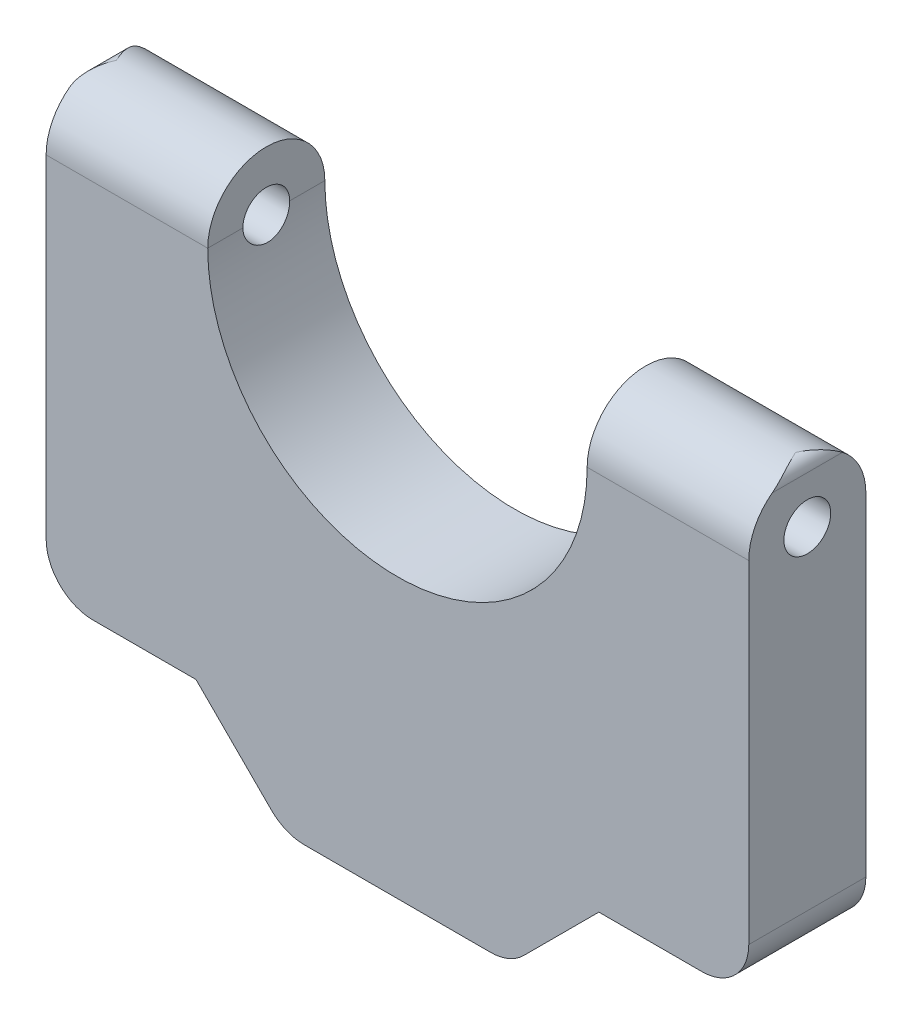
ISO-10303-21;
HEADER;
FILE_DESCRIPTION(('STEP AP214'),'2;1');
FILE_NAME('part.step','',(''),(''),'','','');
FILE_SCHEMA(('AUTOMOTIVE_DESIGN { 1 0 10303 214 1 1 1 1 }'));
ENDSEC;
DATA;
#1=APPLICATION_CONTEXT('core data for automotive mechanical design processes');
#2=APPLICATION_PROTOCOL_DEFINITION('international standard','automotive_design',2000,#1);
#3=PRODUCT_CONTEXT('',#1,'mechanical');
#4=PRODUCT('Part','Part','',(#3));
#5=PRODUCT_RELATED_PRODUCT_CATEGORY('part','',(#4));
#6=PRODUCT_DEFINITION_FORMATION('','',#4);
#7=PRODUCT_DEFINITION_CONTEXT('part definition',#1,'design');
#8=PRODUCT_DEFINITION('design','',#6,#7);
#9=PRODUCT_DEFINITION_SHAPE('','',#8);
#10=(LENGTH_UNIT() NAMED_UNIT(*) SI_UNIT(.MILLI.,.METRE.));
#11=(NAMED_UNIT(*) PLANE_ANGLE_UNIT() SI_UNIT($,.RADIAN.));
#12=(NAMED_UNIT(*) SI_UNIT($,.STERADIAN.) SOLID_ANGLE_UNIT());
#13=UNCERTAINTY_MEASURE_WITH_UNIT(LENGTH_MEASURE(1.E-05),#10,'distance_accuracy_value','');
#14=(GEOMETRIC_REPRESENTATION_CONTEXT(3) GLOBAL_UNCERTAINTY_ASSIGNED_CONTEXT((#13)) GLOBAL_UNIT_ASSIGNED_CONTEXT((#10,
#11,#12)) REPRESENTATION_CONTEXT('',''));
#15=CARTESIAN_POINT('',(0.,0.,0.));
#16=DIRECTION('',(0.,0.,1.));
#17=DIRECTION('',(1.,0.,0.));
#18=AXIS2_PLACEMENT_3D('',#15,#16,#17);
#19=CARTESIAN_POINT('',(-3.97157287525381,-18.,2.5));
#20=DIRECTION('',(0.,0.,1.));
#21=DIRECTION('',(1.,0.,0.));
#22=AXIS2_PLACEMENT_3D('',#19,#20,#21);
#23=CYLINDRICAL_SURFACE('',#22,2.);
#24=CARTESIAN_POINT('',(-3.97157287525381,-18.,2.5));
#25=DIRECTION('',(0.,0.,1.));
#26=DIRECTION('',(1.,0.,0.));
#27=AXIS2_PLACEMENT_3D('',#24,#25,#26);
#28=CIRCLE('',#27,2.);
#29=CARTESIAN_POINT('',(-5.38578643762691,-19.4142135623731,2.5));
#30=VERTEX_POINT('',#29);
#31=CARTESIAN_POINT('',(-3.97157287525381,-20.,2.5));
#32=VERTEX_POINT('',#31);
#33=EDGE_CURVE('E285',#30,#32,#28,.T.);
#34=ORIENTED_EDGE('',*,*,#33,.F.);
#35=DIRECTION('',(0.,0.,1.));
#36=VECTOR('',#35,1.);
#37=CARTESIAN_POINT('',(-5.38578643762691,-19.4142135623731,2.5));
#38=LINE('',#37,#36);
#39=CARTESIAN_POINT('',(-5.38578643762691,-19.4142135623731,-2.5));
#40=VERTEX_POINT('',#39);
#41=EDGE_CURVE('E304',#30,#40,#38,.F.);
#42=ORIENTED_EDGE('',*,*,#41,.T.);
#43=CARTESIAN_POINT('',(-3.97157287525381,-18.,-2.5));
#44=DIRECTION('',(0.,0.,1.));
#45=DIRECTION('',(1.,0.,0.));
#46=AXIS2_PLACEMENT_3D('',#43,#44,#45);
#47=CIRCLE('',#46,2.);
#48=CARTESIAN_POINT('',(-3.97157287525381,-20.,-2.5));
#49=VERTEX_POINT('',#48);
#50=EDGE_CURVE('E17',#40,#49,#47,.T.);
#51=ORIENTED_EDGE('',*,*,#50,.T.);
#52=DIRECTION('',(0.,0.,1.));
#53=VECTOR('',#52,1.);
#54=CARTESIAN_POINT('',(-3.97157287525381,-20.,2.5));
#55=LINE('',#54,#53);
#56=EDGE_CURVE('E302',#49,#32,#55,.T.);
#57=ORIENTED_EDGE('',*,*,#56,.T.);
#58=EDGE_LOOP('',(#34,#42,#51,#57));
#59=FACE_BOUND('',#58,.T.);
#60=ADVANCED_FACE('F14',(#59),#23,.T.);
#61=CARTESIAN_POINT('',(3.97157287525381,-18.,2.5));
#62=DIRECTION('',(0.,0.,1.));
#63=DIRECTION('',(1.,0.,0.));
#64=AXIS2_PLACEMENT_3D('',#61,#62,#63);
#65=CYLINDRICAL_SURFACE('',#64,2.);
#66=CARTESIAN_POINT('',(3.97157287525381,-18.,2.5));
#67=DIRECTION('',(0.,0.,1.));
#68=DIRECTION('',(1.,0.,0.));
#69=AXIS2_PLACEMENT_3D('',#66,#67,#68);
#70=CIRCLE('',#69,2.);
#71=CARTESIAN_POINT('',(3.97157287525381,-20.,2.5));
#72=VERTEX_POINT('',#71);
#73=CARTESIAN_POINT('',(5.38578643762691,-19.4142135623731,2.5));
#74=VERTEX_POINT('',#73);
#75=EDGE_CURVE('E283',#72,#74,#70,.T.);
#76=ORIENTED_EDGE('',*,*,#75,.F.);
#77=DIRECTION('',(0.,0.,1.));
#78=VECTOR('',#77,1.);
#79=CARTESIAN_POINT('',(3.97157287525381,-20.,2.5));
#80=LINE('',#79,#78);
#81=CARTESIAN_POINT('',(3.97157287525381,-20.,-2.5));
#82=VERTEX_POINT('',#81);
#83=EDGE_CURVE('E354',#72,#82,#80,.F.);
#84=ORIENTED_EDGE('',*,*,#83,.T.);
#85=CARTESIAN_POINT('',(3.97157287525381,-18.,-2.5));
#86=DIRECTION('',(0.,0.,1.));
#87=DIRECTION('',(1.,0.,0.));
#88=AXIS2_PLACEMENT_3D('',#85,#86,#87);
#89=CIRCLE('',#88,2.);
#90=CARTESIAN_POINT('',(5.38578643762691,-19.4142135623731,-2.5));
#91=VERTEX_POINT('',#90);
#92=EDGE_CURVE('E292',#82,#91,#89,.T.);
#93=ORIENTED_EDGE('',*,*,#92,.T.);
#94=DIRECTION('',(0.,0.,1.));
#95=VECTOR('',#94,1.);
#96=CARTESIAN_POINT('',(5.38578643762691,-19.4142135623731,2.5));
#97=LINE('',#96,#95);
#98=EDGE_CURVE('E353',#91,#74,#97,.T.);
#99=ORIENTED_EDGE('',*,*,#98,.T.);
#100=EDGE_LOOP('',(#76,#84,#93,#99));
#101=FACE_BOUND('',#100,.T.);
#102=ADVANCED_FACE('F429',(#101),#65,.T.);
#103=CARTESIAN_POINT('',(8.1,2.5,2.5));
#104=DIRECTION('',(1.,0.,0.));
#105=DIRECTION('',(0.,0.,-1.));
#106=AXIS2_PLACEMENT_3D('',#103,#104,#105);
#107=PLANE('',#106);
#108=CARTESIAN_POINT('',(8.1,0.,0.));
#109=DIRECTION('',(1.,0.,0.));
#110=DIRECTION('',(0.,0.,-1.));
#111=AXIS2_PLACEMENT_3D('',#108,#109,#110);
#112=CIRCLE('',#111,2.5);
#113=CARTESIAN_POINT('',(8.1,0.,-2.5));
#114=VERTEX_POINT('',#113);
#115=CARTESIAN_POINT('',(8.1,0.,2.5));
#116=VERTEX_POINT('',#115);
#117=EDGE_CURVE('E266',#114,#116,#112,.T.);
#118=ORIENTED_EDGE('',*,*,#117,.F.);
#119=DIRECTION('',(0.,0.,-1.));
#120=VECTOR('',#119,1.);
#121=CARTESIAN_POINT('',(8.1,0.,2.5));
#122=LINE('',#121,#120);
#123=CARTESIAN_POINT('',(8.1,0.,-1.));
#124=VERTEX_POINT('',#123);
#125=EDGE_CURVE('E293',#124,#114,#122,.T.);
#126=ORIENTED_EDGE('',*,*,#125,.F.);
#127=CARTESIAN_POINT('',(8.1,0.,0.));
#128=DIRECTION('',(1.,0.,0.));
#129=DIRECTION('',(0.,0.,-1.));
#130=AXIS2_PLACEMENT_3D('',#127,#128,#129);
#131=CIRCLE('',#130,1.);
#132=CARTESIAN_POINT('',(8.1,0.,1.));
#133=VERTEX_POINT('',#132);
#134=EDGE_CURVE('E289',#124,#133,#131,.T.);
#135=ORIENTED_EDGE('',*,*,#134,.T.);
#136=DIRECTION('',(0.,0.,-1.));
#137=VECTOR('',#136,1.);
#138=CARTESIAN_POINT('',(8.1,0.,2.5));
#139=LINE('',#138,#137);
#140=EDGE_CURVE('E291',#116,#133,#139,.T.);
#141=ORIENTED_EDGE('',*,*,#140,.F.);
#142=EDGE_LOOP('',(#118,#126,#135,#141));
#143=FACE_BOUND('',#142,.T.);
#144=ADVANCED_FACE('F253',(#143),#107,.F.);
#145=CARTESIAN_POINT('',(14.5,2.,2.5));
#146=DIRECTION('',(0.,0.,1.));
#147=DIRECTION('',(1.,0.,0.));
#148=AXIS2_PLACEMENT_3D('',#145,#146,#147);
#149=CYLINDRICAL_SURFACE('',#148,0.5);
#150=CARTESIAN_POINT('',(14.5,2.5,0.));
#151=CARTESIAN_POINT('',(14.5000008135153,2.5,-7.18470369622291E-11));
#152=CARTESIAN_POINT('',(14.5000016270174,2.49999999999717,-1.49062758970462E-07));
#153=CARTESIAN_POINT('',(14.5000032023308,2.49999999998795,-6.33549140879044E-07));
#154=CARTESIAN_POINT('',(14.5000039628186,2.4999999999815,-9.72637830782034E-07));
#155=CARTESIAN_POINT('',(14.5000054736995,2.4999999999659,-1.79142646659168E-06));
#156=CARTESIAN_POINT('',(14.500006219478,2.49999999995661,-2.27945039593E-06));
#157=CARTESIAN_POINT('',(14.5000076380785,2.49999999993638,-3.34058958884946E-06));
#158=CARTESIAN_POINT('',(14.500008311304,2.49999999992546,-3.91318743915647E-06));
#159=CARTESIAN_POINT('',(14.500010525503,2.4999999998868,-5.93840299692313E-06));
#160=CARTESIAN_POINT('',(14.5000119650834,2.49999999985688,-7.50308854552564E-06));
#161=CARTESIAN_POINT('',(14.5000145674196,2.49999999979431,-1.0765490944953E-05));
#162=CARTESIAN_POINT('',(14.5000157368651,2.49999999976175,-1.24581801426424E-05));
#163=CARTESIAN_POINT('',(14.5000200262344,2.49999999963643,-1.89466793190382E-05));
#164=CARTESIAN_POINT('',(14.5000229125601,2.49999999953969,-2.39026922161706E-05));
#165=CARTESIAN_POINT('',(14.5000277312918,2.49999999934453,-3.37684357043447E-05));
#166=CARTESIAN_POINT('',(14.5000297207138,2.49999999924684,-3.86513767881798E-05));
#167=CARTESIAN_POINT('',(14.5000379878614,2.49999999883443,-5.91153008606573E-05));
#168=CARTESIAN_POINT('',(14.5000441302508,2.49999999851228,-7.47415377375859E-05));
#169=CARTESIAN_POINT('',(14.5000541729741,2.49999999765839,-0.00010419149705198));
#170=CARTESIAN_POINT('',(14.5000582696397,2.49999999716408,-0.000117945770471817));
#171=CARTESIAN_POINT('',(14.5000902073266,2.49999999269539,-0.000216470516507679));
#172=CARTESIAN_POINT('',(14.5001302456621,2.4999999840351,-0.000296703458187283));
#173=CARTESIAN_POINT('',(14.5002791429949,2.49999993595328,-0.000606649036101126));
#174=CARTESIAN_POINT('',(14.5003789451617,2.49999986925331,-0.000839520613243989));
#175=CARTESIAN_POINT('',(14.5007692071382,2.4999994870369,-0.00173647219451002));
#176=CARTESIAN_POINT('',(14.5010691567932,2.49999893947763,-0.00239729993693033));
#177=CARTESIAN_POINT('',(14.5022805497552,2.4999956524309,-0.00507930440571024));
#178=CARTESIAN_POINT('',(14.5031813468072,2.49999072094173,-0.00710406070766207));
#179=CARTESIAN_POINT('',(14.5222637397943,2.49983427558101,-0.0499791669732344));
#180=CARTESIAN_POINT('',(14.5405738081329,2.49868531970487,-0.0907898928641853));
#181=CARTESIAN_POINT('',(14.5763190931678,2.4944593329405,-0.170951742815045));
#182=CARTESIAN_POINT('',(14.5937623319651,2.49145200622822,-0.210303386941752));
#183=CARTESIAN_POINT('',(14.6303383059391,2.4831159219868,-0.293377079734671));
#184=CARTESIAN_POINT('',(14.6494395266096,2.47756346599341,-0.33709111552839));
#185=CARTESIAN_POINT('',(14.6872701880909,2.46404506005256,-0.424817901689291));
#186=CARTESIAN_POINT('',(14.7059942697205,2.45605635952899,-0.468829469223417));
#187=CARTESIAN_POINT('',(14.7382792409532,2.43984831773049,-0.546174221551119));
#188=CARTESIAN_POINT('',(14.7520047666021,2.4321402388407,-0.579546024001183));
#189=CARTESIAN_POINT('',(14.7788580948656,2.41531750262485,-0.646077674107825));
#190=CARTESIAN_POINT('',(14.7919872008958,2.40620612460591,-0.679237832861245));
#191=CARTESIAN_POINT('',(14.8298446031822,2.37709823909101,-0.777160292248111));
#192=CARTESIAN_POINT('',(14.8536131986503,2.35504669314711,-0.841711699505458));
#193=CARTESIAN_POINT('',(14.8870524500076,2.31701053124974,-0.939561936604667));
#194=CARTESIAN_POINT('',(14.898077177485,2.30308370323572,-0.973213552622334));
#195=CARTESIAN_POINT('',(14.9189221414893,2.27355493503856,-1.04033525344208));
#196=CARTESIAN_POINT('',(14.9287373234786,2.25794644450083,-1.07380405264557));
#197=CARTESIAN_POINT('',(14.94724452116,2.22439827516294,-1.1417293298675));
#198=CARTESIAN_POINT('',(14.9558727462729,2.2063885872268,-1.17616890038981));
#199=CARTESIAN_POINT('',(14.9711547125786,2.16860487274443,-1.24445751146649));
#200=CARTESIAN_POINT('',(14.977810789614,2.14883296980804,-1.27830720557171));
#201=CARTESIAN_POINT('',(14.9924682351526,2.09359108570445,-1.36792387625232));
#202=CARTESIAN_POINT('',(14.9983537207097,2.05652094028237,-1.42308937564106));
#203=CARTESIAN_POINT('',(15.0010401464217,1.9782948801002,-1.52991968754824));
#204=CARTESIAN_POINT('',(14.99794536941,1.93719117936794,-1.58161760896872));
#205=CARTESIAN_POINT('',(14.9831710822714,1.86865066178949,-1.66124973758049));
#206=CARTESIAN_POINT('',(14.9752812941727,1.8420873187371,-1.69063193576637));
#207=CARTESIAN_POINT('',(14.9540215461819,1.78859407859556,-1.74712206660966));
#208=CARTESIAN_POINT('',(14.9406485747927,1.7616639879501,-1.77422873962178));
#209=CARTESIAN_POINT('',(14.9108988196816,1.71402067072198,-1.82016530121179));
#210=CARTESIAN_POINT('',(14.8956667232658,1.69314620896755,-1.83956348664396));
#211=CARTESIAN_POINT('',(14.8608482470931,1.65287740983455,-1.87582693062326));
#212=CARTESIAN_POINT('',(14.8412687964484,1.6334807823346,-1.892696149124));
#213=CARTESIAN_POINT('',(14.801785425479,1.6006804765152,-1.92046778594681));
#214=CARTESIAN_POINT('',(14.7826219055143,1.58683358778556,-1.93189631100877));
#215=CARTESIAN_POINT('',(14.7415839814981,1.56157485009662,-1.95236993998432));
#216=CARTESIAN_POINT('',(14.7197103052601,1.55016234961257,-1.96141568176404));
#217=CARTESIAN_POINT('',(14.6735573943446,1.53041362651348,-1.97686461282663));
#218=CARTESIAN_POINT('',(14.6492641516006,1.52209681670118,-1.98325115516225));
#219=CARTESIAN_POINT('',(14.5991228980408,1.50924231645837,-1.99305153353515));
#220=CARTESIAN_POINT('',(14.5732757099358,1.50470264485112,-1.99646692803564));
#221=CARTESIAN_POINT('',(14.523839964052,1.500020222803,-1.99998659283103));
#222=CARTESIAN_POINT('',(14.500313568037,1.49945087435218,-2.00041215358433));
#223=CARTESIAN_POINT('',(14.4535047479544,1.50161606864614,-1.99878741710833));
#224=CARTESIAN_POINT('',(14.430222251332,1.50434959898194,-1.9967378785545));
#225=CARTESIAN_POINT('',(14.385451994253,1.51278483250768,-1.99035378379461));
#226=CARTESIAN_POINT('',(14.3639296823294,1.5183719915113,-1.98610733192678));
#227=CARTESIAN_POINT('',(14.322283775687,1.53213445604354,-1.97550981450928));
#228=CARTESIAN_POINT('',(14.3021603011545,1.54030998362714,-1.96915856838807));
#229=CARTESIAN_POINT('',(14.262675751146,1.55933805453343,-1.95412861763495));
#230=CARTESIAN_POINT('',(14.2434136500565,1.57031078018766,-1.9453432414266));
#231=CARTESIAN_POINT('',(14.2071677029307,1.59414200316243,-1.92586310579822));
#232=CARTESIAN_POINT('',(14.1901849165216,1.60700137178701,-1.91516746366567));
#233=CARTESIAN_POINT('',(14.1524539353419,1.63937954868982,-1.88760212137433));
#234=CARTESIAN_POINT('',(14.1328224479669,1.65953886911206,-1.86995183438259));
#235=CARTESIAN_POINT('',(14.0981105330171,1.70129297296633,-1.83204888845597));
#236=CARTESIAN_POINT('',(14.0830402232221,1.72289081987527,-1.81179058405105));
#237=CARTESIAN_POINT('',(14.052248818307,1.77474918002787,-1.76125278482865));
#238=CARTESIAN_POINT('',(14.0383968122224,1.80522532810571,-1.7300611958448));
#239=CARTESIAN_POINT('',(14.0173986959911,1.86541487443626,-1.66499410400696));
#240=CARTESIAN_POINT('',(14.0102492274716,1.89512864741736,-1.63111995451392));
#241=CARTESIAN_POINT('',(13.9990806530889,1.96776156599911,-1.54356154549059));
#242=CARTESIAN_POINT('',(13.9985314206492,2.00966420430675,-1.48860437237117));
#243=CARTESIAN_POINT('',(14.0063427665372,2.08895092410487,-1.37519654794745));
#244=CARTESIAN_POINT('',(14.0148264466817,2.12626464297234,-1.31670814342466));
#245=CARTESIAN_POINT('',(14.0362135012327,2.1892014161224,-1.20854504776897));
#246=CARTESIAN_POINT('',(14.0480534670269,2.21572142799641,-1.15916747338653));
#247=CARTESIAN_POINT('',(14.0751378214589,2.26511793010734,-1.0594083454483));
#248=CARTESIAN_POINT('',(14.090389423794,2.28798652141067,-1.0090248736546));
#249=CARTESIAN_POINT('',(14.1225687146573,2.32891487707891,-0.91041009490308));
#250=CARTESIAN_POINT('',(14.1393572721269,2.34717050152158,-0.862213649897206));
#251=CARTESIAN_POINT('',(14.1746112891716,2.38040141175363,-0.7656880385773));
#252=CARTESIAN_POINT('',(14.193065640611,2.3953964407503,-0.717361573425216));
#253=CARTESIAN_POINT('',(14.230812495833,2.42196760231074,-0.621669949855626));
#254=CARTESIAN_POINT('',(14.2500701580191,2.43362332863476,-0.574312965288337));
#255=CARTESIAN_POINT('',(14.2899799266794,2.45432167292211,-0.478300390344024));
#256=CARTESIAN_POINT('',(14.3106537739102,2.46329890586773,-0.429639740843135));
#257=CARTESIAN_POINT('',(14.3456766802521,2.47582114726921,-0.348411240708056));
#258=CARTESIAN_POINT('',(14.3598375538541,2.48017947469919,-0.315884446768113));
#259=CARTESIAN_POINT('',(14.3882490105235,2.48757031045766,-0.251091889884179));
#260=CARTESIAN_POINT('',(14.4024974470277,2.4906150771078,-0.218826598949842));
#261=CARTESIAN_POINT('',(14.4296737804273,2.49520209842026,-0.157521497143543));
#262=CARTESIAN_POINT('',(14.4425896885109,2.49686505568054,-0.128485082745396));
#263=CARTESIAN_POINT('',(14.4690047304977,2.49921957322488,-0.0693521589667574));
#264=CARTESIAN_POINT('',(14.4825079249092,2.49987340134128,-0.039255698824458));
#265=CARTESIAN_POINT('',(14.4968182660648,2.49999071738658,-0.00710508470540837));
#266=CARTESIAN_POINT('',(14.4977185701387,2.49999564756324,-0.00508131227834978));
#267=CARTESIAN_POINT('',(14.4989298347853,2.49999893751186,-0.00239955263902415));
#268=CARTESIAN_POINT('',(14.4992301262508,2.49999948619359,-0.00173797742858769));
#269=CARTESIAN_POINT('',(14.4996208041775,2.49999986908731,-0.00084006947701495));
#270=CARTESIAN_POINT('',(14.4997206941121,2.49999993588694,-0.000606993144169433));
#271=CARTESIAN_POINT('',(14.4998697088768,2.49999998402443,-0.000296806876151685));
#272=CARTESIAN_POINT('',(14.4999097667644,2.49999999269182,-0.000216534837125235));
#273=CARTESIAN_POINT('',(14.4999417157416,2.49999999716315,-0.000117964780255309));
#274=CARTESIAN_POINT('',(14.4999458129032,2.49999999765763,-0.000104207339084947));
#275=CARTESIAN_POINT('',(14.4999558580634,2.49999999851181,-7.47505232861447E-05));
#276=CARTESIAN_POINT('',(14.4999620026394,2.49999999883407,-5.91206827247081E-05));
#277=CARTESIAN_POINT('',(14.4999702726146,2.49999999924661,-3.8652706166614E-05));
#278=CARTESIAN_POINT('',(14.4999722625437,2.49999999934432,-3.37692462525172E-05));
#279=CARTESIAN_POINT('',(14.499977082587,2.49999999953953,-2.39025436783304E-05));
#280=CARTESIAN_POINT('',(14.4999799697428,2.4999999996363,-1.89461072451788E-05));
#281=CARTESIAN_POINT('',(14.4999842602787,2.49999999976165,-1.24572194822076E-05));
#282=CARTESIAN_POINT('',(14.4999854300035,2.49999999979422,-1.07644887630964E-05));
#283=CARTESIAN_POINT('',(14.499988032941,2.49999999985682,-7.50205990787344E-06));
#284=CARTESIAN_POINT('',(14.4999894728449,2.49999999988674,-5.93739164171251E-06));
#285=CARTESIAN_POINT('',(14.4999916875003,2.49999999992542,-3.91226780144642E-06));
#286=CARTESIAN_POINT('',(14.4999923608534,2.49999999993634,-3.33970980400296E-06));
#287=CARTESIAN_POINT('',(14.4999937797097,2.49999999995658,-2.27867302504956E-06));
#288=CARTESIAN_POINT('',(14.4999945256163,2.49999999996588,-1.79071184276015E-06));
#289=CARTESIAN_POINT('',(14.4999960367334,2.49999999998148,-9.72075454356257E-07));
#290=CARTESIAN_POINT('',(14.4999967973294,2.49999999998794,-6.33073713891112E-07));
#291=CARTESIAN_POINT('',(14.4999983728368,2.49999999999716,-1.48797224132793E-07));
#292=CARTESIAN_POINT('',(14.499999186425,2.5,7.18523109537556E-11));
#293=CARTESIAN_POINT('',(14.5,2.5,0.));
#294=B_SPLINE_CURVE_WITH_KNOTS('',3,(#150,#151,#152,#153,#154,#155,#156,#157,#158,#159,#160,
#161,#162,#163,#164,#165,#166,#167,#168,#169,#170,#171,#172,#173,#174,#175,#176,#177,#178,#179,
#180,#181,#182,#183,#184,#185,#186,#187,#188,#189,#190,#191,#192,#193,#194,#195,#196,#197,#198,
#199,#200,#201,#202,#203,#204,#205,#206,#207,#208,#209,#210,#211,#212,#213,#214,#215,#216,#217,
#218,#219,#220,#221,#222,#223,#224,#225,#226,#227,#228,#229,#230,#231,#232,#233,#234,#235,#236,
#237,#238,#239,#240,#241,#242,#243,#244,#245,#246,#247,#248,#249,#250,#251,#252,#253,#254,#255,
#256,#257,#258,#259,#260,#261,#262,#263,#264,#265,#266,#267,#268,#269,#270,#271,#272,#273,#274,
#275,#276,#277,#278,#279,#280,#281,#282,#283,#284,#285,#286,#287,#288,#289,#290,#291,#292,#293),
.UNSPECIFIED.,.T.,.F.,(4,2,2,2,2,2,2,2,2,2,2,2,2,2,2,2,2,2,2,2,2,2,2,2,2,2,2,2,2,2,2,2,2,2,2,2,
2,2,2,2,2,2,2,2,2,2,2,2,2,2,2,2,2,2,2,2,2,2,2,2,2,2,2,2,2,2,2,2,2,2,2,4),(0.,
2.43826447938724E-06,4.92425101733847E-06,7.58808774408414E-06,1.02362551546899E-05,
1.65832971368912E-05,2.27504393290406E-05,3.98955917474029E-05,5.56976060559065E-05,
0.000106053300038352,0.000149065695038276,0.000416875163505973,0.00117790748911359,
0.00335386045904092,0.0100033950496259,0.14416746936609,0.273581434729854,0.417601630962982,
0.563010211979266,0.67367272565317,0.784080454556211,1.00044015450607,1.11455134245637,
1.22912428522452,1.34846825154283,1.46767029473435,1.66719752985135,1.86441707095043,
1.98524209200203,2.10613356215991,2.20271662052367,2.29914682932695,2.37760710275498,
2.45604635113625,2.5349695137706,2.61385125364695,2.68410548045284,2.75433817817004,
2.82195057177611,2.88956876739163,2.96081814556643,3.03210053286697,3.13119909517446,
3.23051589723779,3.36701930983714,3.50345428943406,3.70965174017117,3.91869568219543,
4.09030792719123,4.26228652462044,4.4247647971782,4.58623001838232,4.74344571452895,
4.90423327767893,5.01143891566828,5.11762123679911,5.21307812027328,5.31202448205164,
5.31867072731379,5.32084914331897,5.32161084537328,5.321878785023,5.32192180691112,
5.32197217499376,5.32198797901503,5.32200512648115,5.32201129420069,5.32201764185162,
5.32202029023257,5.32202295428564,5.32202544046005,5.32202787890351),.UNSPECIFIED.);
#295=CARTESIAN_POINT('',(14.5,2.5,0.));
#296=VERTEX_POINT('',#295);
#297=CARTESIAN_POINT('',(15.,2.,-1.5));
#298=VERTEX_POINT('',#297);
#299=EDGE_CURVE('E236',#296,#298,#294,.T.);
#300=ORIENTED_EDGE('',*,*,#299,.F.);
#301=CARTESIAN_POINT('',(15.,2.,1.5));
#302=CARTESIAN_POINT('',(14.9999814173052,2.02365218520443,1.46847245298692));
#303=CARTESIAN_POINT('',(14.9983237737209,2.04652559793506,1.43641291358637));
#304=CARTESIAN_POINT('',(14.9922321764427,2.09058347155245,1.37149174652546));
#305=CARTESIAN_POINT('',(14.9878035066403,2.11177106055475,1.3386317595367));
#306=CARTESIAN_POINT('',(14.9767054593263,2.15227910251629,1.27247456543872));
#307=CARTESIAN_POINT('',(14.9700514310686,2.17161120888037,1.23918181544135));
#308=CARTESIAN_POINT('',(14.9548635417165,2.20856282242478,1.1720575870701));
#309=CARTESIAN_POINT('',(14.9463284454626,2.22618119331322,1.13822576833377));
#310=CARTESIAN_POINT('',(14.9217653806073,2.27036987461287,1.04846377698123));
#311=CARTESIAN_POINT('',(14.9044264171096,2.29549882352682,0.99217669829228));
#312=CARTESIAN_POINT('',(14.8666542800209,2.34123860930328,0.878829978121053));
#313=CARTESIAN_POINT('',(14.8462197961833,2.36184752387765,0.821770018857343));
#314=CARTESIAN_POINT('',(14.7813726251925,2.41722118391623,0.649343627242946));
#315=CARTESIAN_POINT('',(14.7335202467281,2.44536662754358,0.533074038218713));
#316=CARTESIAN_POINT('',(14.6545961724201,2.47651931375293,0.348680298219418));
#317=CARTESIAN_POINT('',(14.6248949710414,2.4851182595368,0.280796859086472));
#318=CARTESIAN_POINT('',(14.5648222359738,2.49672051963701,0.14497587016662));
#319=CARTESIAN_POINT('',(14.5344522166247,2.49973537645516,0.0770387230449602));
#320=CARTESIAN_POINT('',(14.5027216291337,2.49999444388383,0.00608575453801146));
#321=CARTESIAN_POINT('',(14.5013607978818,2.49999999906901,0.00304284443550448));
#322=CARTESIAN_POINT('',(14.5,2.5,0.));
#323=B_SPLINE_CURVE_WITH_KNOTS('',3,(#301,#302,#303,#304,#305,#306,#307,#308,#309,#310,#311,
#312,#313,#314,#315,#316,#317,#318,#319,#320,#321,#322),.UNSPECIFIED.,.F.,.F.,(4,2,2,2,2,2,2,2,
2,2,4),(0.,0.118135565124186,0.236046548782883,0.353160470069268,0.47035152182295,
0.662147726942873,0.854025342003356,1.23895364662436,1.46258726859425,1.68575811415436,
1.69575812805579),.UNSPECIFIED.);
#324=CARTESIAN_POINT('',(15.,2.,1.5));
#325=VERTEX_POINT('',#324);
#326=EDGE_CURVE('E256',#325,#296,#323,.T.);
#327=ORIENTED_EDGE('',*,*,#326,.F.);
#328=DIRECTION('',(0.,0.,1.));
#329=VECTOR('',#328,1.);
#330=CARTESIAN_POINT('',(15.,2.,2.5));
#331=LINE('',#330,#329);
#332=EDGE_CURVE('E271',#325,#298,#331,.F.);
#333=ORIENTED_EDGE('',*,*,#332,.T.);
#334=EDGE_LOOP('',(#300,#327,#333));
#335=FACE_BOUND('',#334,.T.);
#336=ADVANCED_FACE('F248',(#335),#149,.T.);
#337=CARTESIAN_POINT('',(15.,0.,0.));
#338=DIRECTION('',(1.,0.,0.));
#339=DIRECTION('',(0.,0.,-1.));
#340=AXIS2_PLACEMENT_3D('',#337,#338,#339);
#341=CYLINDRICAL_SURFACE('',#340,1.);
#342=CARTESIAN_POINT('',(8.1,0.,-1.));
#343=CARTESIAN_POINT('',(8.10000081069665,-0.0280207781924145,-0.999999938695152));
#344=CARTESIAN_POINT('',(8.09985441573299,-0.0560280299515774,-0.998821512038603));
#345=CARTESIAN_POINT('',(8.09927581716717,-0.111840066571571,-0.994121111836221));
#346=CARTESIAN_POINT('',(8.09884363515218,-0.139644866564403,-0.990599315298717));
#347=CARTESIAN_POINT('',(8.09713344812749,-0.222393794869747,-0.97655620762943));
#348=CARTESIAN_POINT('',(8.09544173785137,-0.276780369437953,-0.962557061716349));
#349=CARTESIAN_POINT('',(8.09114133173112,-0.382407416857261,-0.925688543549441));
#350=CARTESIAN_POINT('',(8.08853232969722,-0.433646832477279,-0.902816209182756));
#351=CARTESIAN_POINT('',(8.08268805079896,-0.531563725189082,-0.848859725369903));
#352=CARTESIAN_POINT('',(8.07945282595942,-0.578241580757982,-0.81777625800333));
#353=CARTESIAN_POINT('',(8.07269835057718,-0.665949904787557,-0.748106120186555));
#354=CARTESIAN_POINT('',(8.06917783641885,-0.706952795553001,-0.709484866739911));
#355=CARTESIAN_POINT('',(8.06225933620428,-0.781917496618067,-0.625904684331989));
#356=CARTESIAN_POINT('',(8.05886136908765,-0.815878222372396,-0.580944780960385));
#357=CARTESIAN_POINT('',(8.05256045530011,-0.875892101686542,-0.485785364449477));
#358=CARTESIAN_POINT('',(8.049659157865,-0.901919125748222,-0.435569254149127));
#359=CARTESIAN_POINT('',(8.0446971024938,-0.945158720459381,-0.331440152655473));
#360=CARTESIAN_POINT('',(8.04263626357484,-0.962372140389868,-0.277527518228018));
#361=CARTESIAN_POINT('',(8.03960044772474,-0.987413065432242,-0.167823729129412));
#362=CARTESIAN_POINT('',(8.03862000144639,-0.995287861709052,-0.112043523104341));
#363=CARTESIAN_POINT('',(8.03783922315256,-1.00157437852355,5.60526479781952E-05));
#364=CARTESIAN_POINT('',(8.03803887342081,-0.999986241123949,0.0563754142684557));
#365=CARTESIAN_POINT('',(8.039590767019,-0.987430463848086,0.16762221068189));
#366=CARTESIAN_POINT('',(8.04093657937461,-0.976515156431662,0.22255565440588));
#367=CARTESIAN_POINT('',(8.04461911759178,-0.945696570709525,0.329804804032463));
#368=CARTESIAN_POINT('',(8.04695585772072,-0.925793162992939,0.382120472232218));
#369=CARTESIAN_POINT('',(8.05236431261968,-0.877506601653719,0.482813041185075));
#370=CARTESIAN_POINT('',(8.05543801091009,-0.849100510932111,0.53117883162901));
#371=CARTESIAN_POINT('',(8.06197233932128,-0.784632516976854,0.62247466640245));
#372=CARTESIAN_POINT('',(8.06543297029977,-0.748570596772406,0.665404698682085));
#373=CARTESIAN_POINT('',(8.07237946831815,-0.669530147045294,0.744911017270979));
#374=CARTESIAN_POINT('',(8.07586535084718,-0.626507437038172,0.781443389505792));
#375=CARTESIAN_POINT('',(8.08244923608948,-0.534901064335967,0.846785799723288));
#376=CARTESIAN_POINT('',(8.08554712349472,-0.486315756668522,0.875593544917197));
#377=CARTESIAN_POINT('',(8.0910082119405,-0.384923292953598,0.924668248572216));
#378=CARTESIAN_POINT('',(8.09337074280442,-0.332112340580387,0.944927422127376));
#379=CARTESIAN_POINT('',(8.09708681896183,-0.223840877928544,0.976248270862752));
#380=CARTESIAN_POINT('',(8.09844188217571,-0.168384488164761,0.987323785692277));
#381=CARTESIAN_POINT('',(8.09947900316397,-0.0937748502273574,0.995772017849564));
#382=CARTESIAN_POINT('',(8.09967424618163,-0.0750388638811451,0.997358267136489));
#383=CARTESIAN_POINT('',(8.09993459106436,-0.0375378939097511,0.999470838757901));
#384=CARTESIAN_POINT('',(8.09999991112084,-0.0187730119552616,0.999998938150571));
#385=CARTESIAN_POINT('',(8.1,0.,1.));
#386=B_SPLINE_CURVE_WITH_KNOTS('',3,(#342,#343,#344,#345,#346,#347,#348,#349,#350,#351,#352,
#353,#354,#355,#356,#357,#358,#359,#360,#361,#362,#363,#364,#365,#366,#367,#368,#369,#370,#371,
#372,#373,#374,#375,#376,#377,#378,#379,#380,#381,#382,#383,#384,#385),.UNSPECIFIED.,.F.,.F.,(4,
2,2,2,2,2,2,2,2,2,2,2,2,2,2,2,2,2,2,2,2,4),(0.,0.0840103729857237,0.168014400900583,
0.335702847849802,0.503447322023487,0.671177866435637,0.839696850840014,1.0082417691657,
1.17733593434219,1.34641380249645,1.5146317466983,1.68284716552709,1.85012491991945,
2.01740508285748,2.18514063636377,2.35287656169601,2.52172219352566,2.69061788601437,
2.85966705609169,3.02846100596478,3.0848510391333,3.14114629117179),.UNSPECIFIED.);
#387=EDGE_CURVE('E228',#124,#133,#386,.T.);
#388=ORIENTED_EDGE('',*,*,#387,.T.);
#389=ORIENTED_EDGE('',*,*,#134,.F.);
#390=EDGE_LOOP('',(#388,#389));
#391=FACE_BOUND('',#390,.T.);
#392=CARTESIAN_POINT('',(15.,0.,0.));
#393=DIRECTION('',(1.,0.,0.));
#394=DIRECTION('',(0.,0.,-1.));
#395=AXIS2_PLACEMENT_3D('',#392,#393,#394);
#396=CIRCLE('',#395,1.);
#397=CARTESIAN_POINT('',(15.,0.,-1.));
#398=VERTEX_POINT('',#397);
#399=EDGE_CURVE('E272',#398,#398,#396,.T.);
#400=ORIENTED_EDGE('',*,*,#399,.T.);
#401=EDGE_LOOP('',(#400));
#402=FACE_BOUND('',#401,.T.);
#403=ADVANCED_FACE('F243',(#391,#402),#341,.F.);
#404=CARTESIAN_POINT('',(-8.1,0.,2.5));
#405=DIRECTION('',(-1.,0.,0.));
#406=DIRECTION('',(0.,0.,1.));
#407=AXIS2_PLACEMENT_3D('',#404,#405,#406);
#408=PLANE('',#407);
#409=CARTESIAN_POINT('',(-8.1,0.,0.));
#410=DIRECTION('',(1.,0.,0.));
#411=DIRECTION('',(0.,0.,-1.));
#412=AXIS2_PLACEMENT_3D('',#409,#410,#411);
#413=CIRCLE('',#412,2.5);
#414=CARTESIAN_POINT('',(-8.1,0.,2.5));
#415=VERTEX_POINT('',#414);
#416=CARTESIAN_POINT('',(-8.1,0.,-2.5));
#417=VERTEX_POINT('',#416);
#418=EDGE_CURVE('E164',#415,#417,#413,.F.);
#419=ORIENTED_EDGE('',*,*,#418,.F.);
#420=DIRECTION('',(0.,0.,1.));
#421=VECTOR('',#420,1.);
#422=CARTESIAN_POINT('',(-8.1,0.,2.5));
#423=LINE('',#422,#421);
#424=CARTESIAN_POINT('',(-8.1,0.,1.));
#425=VERTEX_POINT('',#424);
#426=EDGE_CURVE('E337',#415,#425,#423,.F.);
#427=ORIENTED_EDGE('',*,*,#426,.T.);
#428=CARTESIAN_POINT('',(-8.1,0.,0.));
#429=DIRECTION('',(1.,0.,0.));
#430=DIRECTION('',(0.,0.,-1.));
#431=AXIS2_PLACEMENT_3D('',#428,#429,#430);
#432=CIRCLE('',#431,1.);
#433=CARTESIAN_POINT('',(-8.1,0.,-1.));
#434=VERTEX_POINT('',#433);
#435=EDGE_CURVE('E287',#425,#434,#432,.F.);
#436=ORIENTED_EDGE('',*,*,#435,.T.);
#437=DIRECTION('',(0.,0.,1.));
#438=VECTOR('',#437,1.);
#439=CARTESIAN_POINT('',(-8.1,0.,2.5));
#440=LINE('',#439,#438);
#441=EDGE_CURVE('E165',#434,#417,#440,.F.);
#442=ORIENTED_EDGE('',*,*,#441,.T.);
#443=EDGE_LOOP('',(#419,#427,#436,#442));
#444=FACE_BOUND('',#443,.T.);
#445=ADVANCED_FACE('F247',(#444),#408,.F.);
#446=CARTESIAN_POINT('',(15.,0.,0.));
#447=DIRECTION('',(1.,0.,0.));
#448=DIRECTION('',(0.,0.,-1.));
#449=AXIS2_PLACEMENT_3D('',#446,#447,#448);
#450=CYLINDRICAL_SURFACE('',#449,1.);
#451=CARTESIAN_POINT('',(-15.,0.,0.));
#452=DIRECTION('',(1.,0.,0.));
#453=DIRECTION('',(0.,0.,-1.));
#454=AXIS2_PLACEMENT_3D('',#451,#452,#453);
#455=CIRCLE('',#454,1.);
#456=CARTESIAN_POINT('',(-15.,0.,-1.));
#457=VERTEX_POINT('',#456);
#458=EDGE_CURVE('E185',#457,#457,#455,.F.);
#459=ORIENTED_EDGE('',*,*,#458,.T.);
#460=EDGE_LOOP('',(#459));
#461=FACE_BOUND('',#460,.T.);
#462=CARTESIAN_POINT('',(-8.1,0.,1.));
#463=CARTESIAN_POINT('',(-8.10000081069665,-0.0280207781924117,0.999999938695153));
#464=CARTESIAN_POINT('',(-8.09985441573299,-0.0560280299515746,0.998821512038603));
#465=CARTESIAN_POINT('',(-8.09927581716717,-0.111840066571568,0.994121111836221));
#466=CARTESIAN_POINT('',(-8.09884363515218,-0.1396448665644,0.990599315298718));
#467=CARTESIAN_POINT('',(-8.09713344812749,-0.222393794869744,0.976556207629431));
#468=CARTESIAN_POINT('',(-8.09544173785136,-0.27678036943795,0.96255706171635));
#469=CARTESIAN_POINT('',(-8.09114133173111,-0.382407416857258,0.925688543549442));
#470=CARTESIAN_POINT('',(-8.08853232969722,-0.433646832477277,0.902816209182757));
#471=CARTESIAN_POINT('',(-8.08268805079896,-0.53156372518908,0.848859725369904));
#472=CARTESIAN_POINT('',(-8.07945282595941,-0.57824158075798,0.817776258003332));
#473=CARTESIAN_POINT('',(-8.07269835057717,-0.665949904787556,0.748106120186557));
#474=CARTESIAN_POINT('',(-8.06917783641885,-0.706952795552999,0.709484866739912));
#475=CARTESIAN_POINT('',(-8.06225933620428,-0.781917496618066,0.62590468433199));
#476=CARTESIAN_POINT('',(-8.05886136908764,-0.815878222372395,0.580944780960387));
#477=CARTESIAN_POINT('',(-8.0525604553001,-0.875892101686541,0.485785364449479));
#478=CARTESIAN_POINT('',(-8.04965915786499,-0.901919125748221,0.435569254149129));
#479=CARTESIAN_POINT('',(-8.0446971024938,-0.94515872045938,0.331440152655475));
#480=CARTESIAN_POINT('',(-8.04263626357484,-0.962372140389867,0.27752751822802));
#481=CARTESIAN_POINT('',(-8.03960044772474,-0.987413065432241,0.167823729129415));
#482=CARTESIAN_POINT('',(-8.03862000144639,-0.995287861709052,0.112043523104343));
#483=CARTESIAN_POINT('',(-8.03783922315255,-1.00157437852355,-5.60526479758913E-05));
#484=CARTESIAN_POINT('',(-8.03803887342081,-0.999986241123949,-0.0563754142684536));
#485=CARTESIAN_POINT('',(-8.039590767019,-0.987430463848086,-0.167622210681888));
#486=CARTESIAN_POINT('',(-8.0409365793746,-0.976515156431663,-0.222555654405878));
#487=CARTESIAN_POINT('',(-8.04461911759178,-0.945696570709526,-0.329804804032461));
#488=CARTESIAN_POINT('',(-8.04695585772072,-0.925793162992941,-0.382120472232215));
#489=CARTESIAN_POINT('',(-8.05236431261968,-0.877506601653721,-0.482813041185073));
#490=CARTESIAN_POINT('',(-8.05543801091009,-0.849100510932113,-0.531178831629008));
#491=CARTESIAN_POINT('',(-8.06197233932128,-0.784632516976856,-0.622474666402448));
#492=CARTESIAN_POINT('',(-8.06543297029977,-0.748570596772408,-0.665404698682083));
#493=CARTESIAN_POINT('',(-8.07237946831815,-0.669530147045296,-0.744911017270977));
#494=CARTESIAN_POINT('',(-8.07586535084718,-0.626507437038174,-0.78144338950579));
#495=CARTESIAN_POINT('',(-8.08244923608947,-0.534901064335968,-0.846785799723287));
#496=CARTESIAN_POINT('',(-8.08554712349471,-0.486315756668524,-0.875593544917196));
#497=CARTESIAN_POINT('',(-8.0910082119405,-0.3849232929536,-0.924668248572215));
#498=CARTESIAN_POINT('',(-8.09337074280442,-0.332112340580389,-0.944927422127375));
#499=CARTESIAN_POINT('',(-8.09708681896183,-0.223840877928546,-0.976248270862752));
#500=CARTESIAN_POINT('',(-8.0984418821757,-0.168384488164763,-0.987323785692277));
#501=CARTESIAN_POINT('',(-8.09947900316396,-0.0937748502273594,-0.995772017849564));
#502=CARTESIAN_POINT('',(-8.09967424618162,-0.0750388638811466,-0.997358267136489));
#503=CARTESIAN_POINT('',(-8.09993459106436,-0.0375378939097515,-0.999470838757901));
#504=CARTESIAN_POINT('',(-8.09999991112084,-0.0187730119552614,-0.999998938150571));
#505=CARTESIAN_POINT('',(-8.1,0.,-1.));
#506=B_SPLINE_CURVE_WITH_KNOTS('',3,(#462,#463,#464,#465,#466,#467,#468,#469,#470,#471,#472,
#473,#474,#475,#476,#477,#478,#479,#480,#481,#482,#483,#484,#485,#486,#487,#488,#489,#490,#491,
#492,#493,#494,#495,#496,#497,#498,#499,#500,#501,#502,#503,#504,#505),.UNSPECIFIED.,.F.,.F.,(4,
2,2,2,2,2,2,2,2,2,2,2,2,2,2,2,2,2,2,2,2,4),(0.,0.0840103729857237,0.168014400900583,
0.335702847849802,0.503447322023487,0.671177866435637,0.839696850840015,1.0082417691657,
1.17733593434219,1.34641380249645,1.5146317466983,1.68284716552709,1.85012491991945,
2.01740508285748,2.18514063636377,2.35287656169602,2.52172219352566,2.69061788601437,
2.85966705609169,3.02846100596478,3.0848510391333,3.14114629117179),.UNSPECIFIED.);
#507=EDGE_CURVE('E221',#425,#434,#506,.T.);
#508=ORIENTED_EDGE('',*,*,#507,.T.);
#509=ORIENTED_EDGE('',*,*,#435,.F.);
#510=EDGE_LOOP('',(#508,#509));
#511=FACE_BOUND('',#510,.T.);
#512=ADVANCED_FACE('F556',(#461,#511),#450,.F.);
#513=CARTESIAN_POINT('',(-14.5,2.,2.5));
#514=DIRECTION('',(0.,0.,1.));
#515=DIRECTION('',(1.,0.,0.));
#516=AXIS2_PLACEMENT_3D('',#513,#514,#515);
#517=CYLINDRICAL_SURFACE('',#516,0.5);
#518=CARTESIAN_POINT('',(-15.,2.,1.5));
#519=CARTESIAN_POINT('',(-14.9999814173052,2.02365218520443,1.46847245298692));
#520=CARTESIAN_POINT('',(-14.9983237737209,2.04652559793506,1.43641291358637));
#521=CARTESIAN_POINT('',(-14.9922321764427,2.09058347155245,1.37149174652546));
#522=CARTESIAN_POINT('',(-14.9878035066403,2.11177106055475,1.3386317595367));
#523=CARTESIAN_POINT('',(-14.9767054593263,2.15227910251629,1.27247456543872));
#524=CARTESIAN_POINT('',(-14.9700514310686,2.17161120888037,1.23918181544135));
#525=CARTESIAN_POINT('',(-14.9548635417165,2.20856282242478,1.1720575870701));
#526=CARTESIAN_POINT('',(-14.9463284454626,2.22618119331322,1.13822576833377));
#527=CARTESIAN_POINT('',(-14.9217653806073,2.27036987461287,1.04846377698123));
#528=CARTESIAN_POINT('',(-14.9044264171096,2.29549882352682,0.99217669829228));
#529=CARTESIAN_POINT('',(-14.8666542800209,2.34123860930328,0.878829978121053));
#530=CARTESIAN_POINT('',(-14.8462197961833,2.36184752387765,0.821770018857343));
#531=CARTESIAN_POINT('',(-14.7813726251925,2.41722118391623,0.649343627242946));
#532=CARTESIAN_POINT('',(-14.7335202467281,2.44536662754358,0.533074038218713));
#533=CARTESIAN_POINT('',(-14.6545961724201,2.47651931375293,0.348680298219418));
#534=CARTESIAN_POINT('',(-14.6248949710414,2.4851182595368,0.280796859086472));
#535=CARTESIAN_POINT('',(-14.5648222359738,2.49672051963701,0.14497587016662));
#536=CARTESIAN_POINT('',(-14.5344522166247,2.49973537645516,0.0770387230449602));
#537=CARTESIAN_POINT('',(-14.5027216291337,2.49999444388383,0.00608575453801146));
#538=CARTESIAN_POINT('',(-14.5013607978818,2.49999999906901,0.00304284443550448));
#539=CARTESIAN_POINT('',(-14.5,2.5,0.));
#540=B_SPLINE_CURVE_WITH_KNOTS('',3,(#518,#519,#520,#521,#522,#523,#524,#525,#526,#527,#528,
#529,#530,#531,#532,#533,#534,#535,#536,#537,#538,#539),.UNSPECIFIED.,.F.,.F.,(4,2,2,2,2,2,2,2,
2,2,4),(0.,0.118135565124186,0.236046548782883,0.353160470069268,0.47035152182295,
0.662147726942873,0.854025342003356,1.23895364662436,1.46258726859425,1.68575811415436,
1.69575812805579),.UNSPECIFIED.);
#541=CARTESIAN_POINT('',(-14.5,2.5,0.));
#542=VERTEX_POINT('',#541);
#543=CARTESIAN_POINT('',(-15.,2.,1.5));
#544=VERTEX_POINT('',#543);
#545=EDGE_CURVE('E177',#542,#544,#540,.F.);
#546=ORIENTED_EDGE('',*,*,#545,.F.);
#547=CARTESIAN_POINT('',(-15.,2.,-1.5));
#548=CARTESIAN_POINT('',(-14.9999814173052,2.02365218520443,-1.46847245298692));
#549=CARTESIAN_POINT('',(-14.9983237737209,2.04652559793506,-1.43641291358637));
#550=CARTESIAN_POINT('',(-14.9922321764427,2.09058347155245,-1.37149174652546));
#551=CARTESIAN_POINT('',(-14.9878035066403,2.11177106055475,-1.3386317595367));
#552=CARTESIAN_POINT('',(-14.9767054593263,2.15227910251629,-1.27247456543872));
#553=CARTESIAN_POINT('',(-14.9700514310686,2.17161120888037,-1.23918181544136));
#554=CARTESIAN_POINT('',(-14.9548635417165,2.20856282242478,-1.1720575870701));
#555=CARTESIAN_POINT('',(-14.9463284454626,2.22618119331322,-1.13822576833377));
#556=CARTESIAN_POINT('',(-14.9217653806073,2.27036987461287,-1.04846377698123));
#557=CARTESIAN_POINT('',(-14.9044264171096,2.29549882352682,-0.992176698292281));
#558=CARTESIAN_POINT('',(-14.8666542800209,2.34123860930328,-0.878829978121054));
#559=CARTESIAN_POINT('',(-14.8462197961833,2.36184752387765,-0.821770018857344));
#560=CARTESIAN_POINT('',(-14.7813726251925,2.41722118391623,-0.649343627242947));
#561=CARTESIAN_POINT('',(-14.7335202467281,2.44536662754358,-0.533074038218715));
#562=CARTESIAN_POINT('',(-14.6545961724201,2.47651931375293,-0.34868029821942));
#563=CARTESIAN_POINT('',(-14.6248949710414,2.4851182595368,-0.280796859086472));
#564=CARTESIAN_POINT('',(-14.5648222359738,2.49672051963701,-0.144975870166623));
#565=CARTESIAN_POINT('',(-14.5344522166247,2.49973537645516,-0.0770387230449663));
#566=CARTESIAN_POINT('',(-14.5027216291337,2.49999444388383,-0.0060857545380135));
#567=CARTESIAN_POINT('',(-14.5013607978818,2.49999999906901,-0.00304284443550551));
#568=CARTESIAN_POINT('',(-14.5,2.5,0.));
#569=B_SPLINE_CURVE_WITH_KNOTS('',3,(#547,#548,#549,#550,#551,#552,#553,#554,#555,#556,#557,
#558,#559,#560,#561,#562,#563,#564,#565,#566,#567,#568),.UNSPECIFIED.,.F.,.F.,(4,2,2,2,2,2,2,2,
2,2,4),(0.,0.118135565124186,0.236046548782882,0.353160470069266,0.47035152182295,
0.662147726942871,0.854025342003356,1.23895364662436,1.46258726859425,1.68575811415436,
1.69575812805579),.UNSPECIFIED.);
#570=CARTESIAN_POINT('',(-15.,2.,-1.5));
#571=VERTEX_POINT('',#570);
#572=EDGE_CURVE('E195',#571,#542,#569,.T.);
#573=ORIENTED_EDGE('',*,*,#572,.F.);
#574=DIRECTION('',(0.,0.,-1.));
#575=VECTOR('',#574,1.);
#576=CARTESIAN_POINT('',(-15.,2.,2.5));
#577=LINE('',#576,#575);
#578=EDGE_CURVE('E178',#571,#544,#577,.F.);
#579=ORIENTED_EDGE('',*,*,#578,.T.);
#580=EDGE_LOOP('',(#546,#573,#579));
#581=FACE_BOUND('',#580,.T.);
#582=ADVANCED_FACE('F201',(#581),#517,.T.);
#583=CARTESIAN_POINT('',(-14.5,2.,2.5));
#584=DIRECTION('',(0.,0.,1.));
#585=DIRECTION('',(1.,0.,0.));
#586=AXIS2_PLACEMENT_3D('',#583,#584,#585);
#587=PLANE('',#586);
#588=DIRECTION('',(1.,0.,0.));
#589=VECTOR('',#588,1.);
#590=CARTESIAN_POINT('',(15.,0.,2.5));
#591=LINE('',#590,#589);
#592=CARTESIAN_POINT('',(15.,0.,2.5));
#593=VERTEX_POINT('',#592);
#594=EDGE_CURVE('E265',#116,#593,#591,.T.);
#595=ORIENTED_EDGE('',*,*,#594,.F.);
#596=CARTESIAN_POINT('',(0.,0.,2.5));
#597=DIRECTION('',(0.,0.,1.));
#598=DIRECTION('',(1.,0.,0.));
#599=AXIS2_PLACEMENT_3D('',#596,#597,#598);
#600=CIRCLE('',#599,8.1);
#601=EDGE_CURVE('E161',#116,#415,#600,.F.);
#602=ORIENTED_EDGE('',*,*,#601,.T.);
#603=DIRECTION('',(1.,0.,0.));
#604=VECTOR('',#603,1.);
#605=CARTESIAN_POINT('',(15.,0.,2.5));
#606=LINE('',#605,#604);
#607=CARTESIAN_POINT('',(-15.,0.,2.5));
#608=VERTEX_POINT('',#607);
#609=EDGE_CURVE('E155',#608,#415,#606,.T.);
#610=ORIENTED_EDGE('',*,*,#609,.F.);
#611=DIRECTION('',(0.,1.,0.));
#612=VECTOR('',#611,1.);
#613=CARTESIAN_POINT('',(-15.,2.,2.5));
#614=LINE('',#613,#612);
#615=CARTESIAN_POINT('',(-15.,-14.2,2.5));
#616=VERTEX_POINT('',#615);
#617=EDGE_CURVE('E159',#608,#616,#614,.F.);
#618=ORIENTED_EDGE('',*,*,#617,.T.);
#619=CARTESIAN_POINT('',(-13.,-14.2,2.5));
#620=DIRECTION('',(0.,0.,1.));
#621=DIRECTION('',(1.,0.,0.));
#622=AXIS2_PLACEMENT_3D('',#619,#620,#621);
#623=CIRCLE('',#622,2.);
#624=CARTESIAN_POINT('',(-13.,-16.2,2.5));
#625=VERTEX_POINT('',#624);
#626=EDGE_CURVE('E280',#625,#616,#623,.F.);
#627=ORIENTED_EDGE('',*,*,#626,.F.);
#628=DIRECTION('',(1.,0.,0.));
#629=VECTOR('',#628,1.);
#630=CARTESIAN_POINT('',(-13.,-16.2,2.5));
#631=LINE('',#630,#629);
#632=CARTESIAN_POINT('',(-8.6,-16.2,2.5));
#633=VERTEX_POINT('',#632);
#634=EDGE_CURVE('E360',#625,#633,#631,.T.);
#635=ORIENTED_EDGE('',*,*,#634,.T.);
#636=DIRECTION('',(-0.707106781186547,0.707106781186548,0.));
#637=VECTOR('',#636,1.);
#638=CARTESIAN_POINT('',(-8.6,-16.2,2.5));
#639=LINE('',#638,#637);
#640=EDGE_CURVE('E358',#633,#30,#639,.F.);
#641=ORIENTED_EDGE('',*,*,#640,.T.);
#642=ORIENTED_EDGE('',*,*,#33,.T.);
#643=DIRECTION('',(1.,0.,0.));
#644=VECTOR('',#643,1.);
#645=CARTESIAN_POINT('',(-3.97157287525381,-20.,2.5));
#646=LINE('',#645,#644);
#647=EDGE_CURVE('E312',#32,#72,#646,.T.);
#648=ORIENTED_EDGE('',*,*,#647,.T.);
#649=ORIENTED_EDGE('',*,*,#75,.T.);
#650=DIRECTION('',(-0.707106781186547,-0.707106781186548,0.));
#651=VECTOR('',#650,1.);
#652=CARTESIAN_POINT('',(5.38578643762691,-19.4142135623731,2.5));
#653=LINE('',#652,#651);
#654=CARTESIAN_POINT('',(8.6,-16.2,2.5));
#655=VERTEX_POINT('',#654);
#656=EDGE_CURVE('E350',#74,#655,#653,.F.);
#657=ORIENTED_EDGE('',*,*,#656,.T.);
#658=DIRECTION('',(1.,0.,0.));
#659=VECTOR('',#658,1.);
#660=CARTESIAN_POINT('',(8.6,-16.2,2.5));
#661=LINE('',#660,#659);
#662=CARTESIAN_POINT('',(13.,-16.2,2.5));
#663=VERTEX_POINT('',#662);
#664=EDGE_CURVE('E279',#655,#663,#661,.T.);
#665=ORIENTED_EDGE('',*,*,#664,.T.);
#666=CARTESIAN_POINT('',(13.,-14.2,2.5));
#667=DIRECTION('',(0.,0.,1.));
#668=DIRECTION('',(1.,0.,0.));
#669=AXIS2_PLACEMENT_3D('',#666,#667,#668);
#670=CIRCLE('',#669,2.);
#671=CARTESIAN_POINT('',(15.,-14.2,2.5));
#672=VERTEX_POINT('',#671);
#673=EDGE_CURVE('E277',#672,#663,#670,.F.);
#674=ORIENTED_EDGE('',*,*,#673,.F.);
#675=DIRECTION('',(0.,1.,0.));
#676=VECTOR('',#675,1.);
#677=CARTESIAN_POINT('',(15.,-14.2,2.5));
#678=LINE('',#677,#676);
#679=EDGE_CURVE('E341',#672,#593,#678,.T.);
#680=ORIENTED_EDGE('',*,*,#679,.T.);
#681=EDGE_LOOP('',(#595,#602,#610,#618,#627,#635,#641,#642,#648,#649,#657,#665,#674,#680));
#682=FACE_BOUND('',#681,.T.);
#683=ADVANCED_FACE('F158',(#682),#587,.T.);
#684=CARTESIAN_POINT('',(-13.,-14.2,2.5));
#685=DIRECTION('',(0.,0.,1.));
#686=DIRECTION('',(1.,0.,0.));
#687=AXIS2_PLACEMENT_3D('',#684,#685,#686);
#688=CYLINDRICAL_SURFACE('',#687,2.);
#689=ORIENTED_EDGE('',*,*,#626,.T.);
#690=DIRECTION('',(0.,0.,-1.));
#691=VECTOR('',#690,1.);
#692=CARTESIAN_POINT('',(-15.,-14.2,2.5));
#693=LINE('',#692,#691);
#694=CARTESIAN_POINT('',(-15.,-14.2,-2.5));
#695=VERTEX_POINT('',#694);
#696=EDGE_CURVE('E173',#616,#695,#693,.T.);
#697=ORIENTED_EDGE('',*,*,#696,.T.);
#698=CARTESIAN_POINT('',(-13.,-14.2,-2.5));
#699=DIRECTION('',(0.,0.,1.));
#700=DIRECTION('',(1.,0.,0.));
#701=AXIS2_PLACEMENT_3D('',#698,#699,#700);
#702=CIRCLE('',#701,2.);
#703=CARTESIAN_POINT('',(-13.,-16.2,-2.5));
#704=VERTEX_POINT('',#703);
#705=EDGE_CURVE('E148',#695,#704,#702,.T.);
#706=ORIENTED_EDGE('',*,*,#705,.T.);
#707=DIRECTION('',(0.,0.,1.));
#708=VECTOR('',#707,1.);
#709=CARTESIAN_POINT('',(-13.,-16.2,2.5));
#710=LINE('',#709,#708);
#711=EDGE_CURVE('E282',#704,#625,#710,.T.);
#712=ORIENTED_EDGE('',*,*,#711,.T.);
#713=EDGE_LOOP('',(#689,#697,#706,#712));
#714=FACE_BOUND('',#713,.T.);
#715=ADVANCED_FACE('F435',(#714),#688,.T.);
#716=CARTESIAN_POINT('',(-13.,-16.2,2.5));
#717=DIRECTION('',(0.,1.,0.));
#718=DIRECTION('',(0.,0.,1.));
#719=AXIS2_PLACEMENT_3D('',#716,#717,#718);
#720=PLANE('',#719);
#721=DIRECTION('',(0.,0.,1.));
#722=VECTOR('',#721,1.);
#723=CARTESIAN_POINT('',(-8.6,-16.2,2.5));
#724=LINE('',#723,#722);
#725=CARTESIAN_POINT('',(-8.6,-16.2,-2.5));
#726=VERTEX_POINT('',#725);
#727=EDGE_CURVE('E132',#726,#633,#724,.T.);
#728=ORIENTED_EDGE('',*,*,#727,.T.);
#729=ORIENTED_EDGE('',*,*,#634,.F.);
#730=ORIENTED_EDGE('',*,*,#711,.F.);
#731=DIRECTION('',(1.,0.,0.));
#732=VECTOR('',#731,1.);
#733=CARTESIAN_POINT('',(-14.5,-16.2,-2.5));
#734=LINE('',#733,#732);
#735=EDGE_CURVE('E323',#704,#726,#734,.T.);
#736=ORIENTED_EDGE('',*,*,#735,.T.);
#737=EDGE_LOOP('',(#728,#729,#730,#736));
#738=FACE_BOUND('',#737,.T.);
#739=ADVANCED_FACE('F432',(#738),#720,.F.);
#740=CARTESIAN_POINT('',(-8.6,-16.2,2.5));
#741=DIRECTION('',(0.707106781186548,0.707106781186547,0.));
#742=DIRECTION('',(-0.707106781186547,0.707106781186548,0.));
#743=AXIS2_PLACEMENT_3D('',#740,#741,#742);
#744=PLANE('',#743);
#745=ORIENTED_EDGE('',*,*,#41,.F.);
#746=ORIENTED_EDGE('',*,*,#640,.F.);
#747=ORIENTED_EDGE('',*,*,#727,.F.);
#748=DIRECTION('',(0.707106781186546,-0.707106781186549,0.));
#749=VECTOR('',#748,1.);
#750=CARTESIAN_POINT('',(-8.6,-16.2,-2.5));
#751=LINE('',#750,#749);
#752=EDGE_CURVE('E318',#726,#40,#751,.T.);
#753=ORIENTED_EDGE('',*,*,#752,.T.);
#754=EDGE_LOOP('',(#745,#746,#747,#753));
#755=FACE_BOUND('',#754,.T.);
#756=ADVANCED_FACE('F430',(#755),#744,.F.);
#757=CARTESIAN_POINT('',(-3.97157287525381,-20.,2.5));
#758=DIRECTION('',(0.,1.,0.));
#759=DIRECTION('',(0.,0.,1.));
#760=AXIS2_PLACEMENT_3D('',#757,#758,#759);
#761=PLANE('',#760);
#762=ORIENTED_EDGE('',*,*,#83,.F.);
#763=ORIENTED_EDGE('',*,*,#647,.F.);
#764=ORIENTED_EDGE('',*,*,#56,.F.);
#765=DIRECTION('',(1.,0.,0.));
#766=VECTOR('',#765,1.);
#767=CARTESIAN_POINT('',(-14.5,-20.,-2.5));
#768=LINE('',#767,#766);
#769=EDGE_CURVE('E310',#49,#82,#768,.T.);
#770=ORIENTED_EDGE('',*,*,#769,.T.);
#771=EDGE_LOOP('',(#762,#763,#764,#770));
#772=FACE_BOUND('',#771,.T.);
#773=ADVANCED_FACE('F309',(#772),#761,.F.);
#774=CARTESIAN_POINT('',(5.38578643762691,-19.4142135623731,2.5));
#775=DIRECTION('',(-0.707106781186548,0.707106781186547,0.));
#776=DIRECTION('',(-0.707106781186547,-0.707106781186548,0.));
#777=AXIS2_PLACEMENT_3D('',#774,#775,#776);
#778=PLANE('',#777);
#779=DIRECTION('',(0.,0.,1.));
#780=VECTOR('',#779,1.);
#781=CARTESIAN_POINT('',(8.6,-16.2,2.5));
#782=LINE('',#781,#780);
#783=CARTESIAN_POINT('',(8.6,-16.2,-2.5));
#784=VERTEX_POINT('',#783);
#785=EDGE_CURVE('E347',#784,#655,#782,.T.);
#786=ORIENTED_EDGE('',*,*,#785,.T.);
#787=ORIENTED_EDGE('',*,*,#656,.F.);
#788=ORIENTED_EDGE('',*,*,#98,.F.);
#789=DIRECTION('',(0.707106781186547,0.707106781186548,0.));
#790=VECTOR('',#789,1.);
#791=CARTESIAN_POINT('',(5.38578643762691,-19.4142135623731,-2.5));
#792=LINE('',#791,#790);
#793=EDGE_CURVE('E317',#91,#784,#792,.T.);
#794=ORIENTED_EDGE('',*,*,#793,.T.);
#795=EDGE_LOOP('',(#786,#787,#788,#794));
#796=FACE_BOUND('',#795,.T.);
#797=ADVANCED_FACE('F427',(#796),#778,.F.);
#798=CARTESIAN_POINT('',(8.6,-16.2,2.5));
#799=DIRECTION('',(0.,1.,0.));
#800=DIRECTION('',(0.,0.,1.));
#801=AXIS2_PLACEMENT_3D('',#798,#799,#800);
#802=PLANE('',#801);
#803=DIRECTION('',(0.,0.,1.));
#804=VECTOR('',#803,1.);
#805=CARTESIAN_POINT('',(13.,-16.2,2.5));
#806=LINE('',#805,#804);
#807=CARTESIAN_POINT('',(13.,-16.2,-2.5));
#808=VERTEX_POINT('',#807);
#809=EDGE_CURVE('E276',#663,#808,#806,.F.);
#810=ORIENTED_EDGE('',*,*,#809,.F.);
#811=ORIENTED_EDGE('',*,*,#664,.F.);
#812=ORIENTED_EDGE('',*,*,#785,.F.);
#813=DIRECTION('',(1.,0.,0.));
#814=VECTOR('',#813,1.);
#815=CARTESIAN_POINT('',(-14.5,-16.2,-2.5));
#816=LINE('',#815,#814);
#817=EDGE_CURVE('E321',#784,#808,#816,.T.);
#818=ORIENTED_EDGE('',*,*,#817,.T.);
#819=EDGE_LOOP('',(#810,#811,#812,#818));
#820=FACE_BOUND('',#819,.T.);
#821=ADVANCED_FACE('F487',(#820),#802,.F.);
#822=CARTESIAN_POINT('',(13.,-14.2,2.5));
#823=DIRECTION('',(0.,0.,1.));
#824=DIRECTION('',(1.,0.,0.));
#825=AXIS2_PLACEMENT_3D('',#822,#823,#824);
#826=CYLINDRICAL_SURFACE('',#825,2.);
#827=ORIENTED_EDGE('',*,*,#673,.T.);
#828=ORIENTED_EDGE('',*,*,#809,.T.);
#829=CARTESIAN_POINT('',(13.,-14.2,-2.5));
#830=DIRECTION('',(0.,0.,1.));
#831=DIRECTION('',(1.,0.,0.));
#832=AXIS2_PLACEMENT_3D('',#829,#830,#831);
#833=CIRCLE('',#832,2.);
#834=CARTESIAN_POINT('',(15.,-14.2,-2.5));
#835=VERTEX_POINT('',#834);
#836=EDGE_CURVE('E386',#808,#835,#833,.T.);
#837=ORIENTED_EDGE('',*,*,#836,.T.);
#838=DIRECTION('',(0.,0.,1.));
#839=VECTOR('',#838,1.);
#840=CARTESIAN_POINT('',(15.,-14.2,2.5));
#841=LINE('',#840,#839);
#842=EDGE_CURVE('E275',#835,#672,#841,.T.);
#843=ORIENTED_EDGE('',*,*,#842,.T.);
#844=EDGE_LOOP('',(#827,#828,#837,#843));
#845=FACE_BOUND('',#844,.T.);
#846=ADVANCED_FACE('F480',(#845),#826,.T.);
#847=CARTESIAN_POINT('',(15.,-14.2,2.5));
#848=DIRECTION('',(-1.,0.,0.));
#849=DIRECTION('',(0.,0.,1.));
#850=AXIS2_PLACEMENT_3D('',#847,#848,#849);
#851=PLANE('',#850);
#852=CARTESIAN_POINT('',(15.,0.,0.));
#853=DIRECTION('',(1.,0.,0.));
#854=DIRECTION('',(0.,0.,-1.));
#855=AXIS2_PLACEMENT_3D('',#852,#853,#854);
#856=CIRCLE('',#855,2.5);
#857=CARTESIAN_POINT('',(15.,0.,-2.5));
#858=VERTEX_POINT('',#857);
#859=EDGE_CURVE('E269',#298,#858,#856,.F.);
#860=ORIENTED_EDGE('',*,*,#859,.F.);
#861=ORIENTED_EDGE('',*,*,#332,.F.);
#862=CARTESIAN_POINT('',(15.,0.,0.));
#863=DIRECTION('',(1.,0.,0.));
#864=DIRECTION('',(0.,0.,-1.));
#865=AXIS2_PLACEMENT_3D('',#862,#863,#864);
#866=CIRCLE('',#865,2.5);
#867=EDGE_CURVE('E262',#593,#325,#866,.F.);
#868=ORIENTED_EDGE('',*,*,#867,.F.);
#869=ORIENTED_EDGE('',*,*,#679,.F.);
#870=ORIENTED_EDGE('',*,*,#842,.F.);
#871=DIRECTION('',(0.,1.,0.));
#872=VECTOR('',#871,1.);
#873=CARTESIAN_POINT('',(15.,2.,-2.5));
#874=LINE('',#873,#872);
#875=EDGE_CURVE('E388',#835,#858,#874,.T.);
#876=ORIENTED_EDGE('',*,*,#875,.T.);
#877=EDGE_LOOP('',(#860,#861,#868,#869,#870,#876));
#878=FACE_BOUND('',#877,.T.);
#879=ORIENTED_EDGE('',*,*,#399,.F.);
#880=EDGE_LOOP('',(#879));
#881=FACE_BOUND('',#880,.T.);
#882=ADVANCED_FACE('F420',(#878,#881),#851,.F.);
#883=CARTESIAN_POINT('',(15.,0.,0.));
#884=DIRECTION('',(1.,0.,0.));
#885=DIRECTION('',(0.,0.,-1.));
#886=AXIS2_PLACEMENT_3D('',#883,#884,#885);
#887=CYLINDRICAL_SURFACE('',#886,2.5);
#888=ORIENTED_EDGE('',*,*,#326,.T.);
#889=ORIENTED_EDGE('',*,*,#299,.T.);
#890=ORIENTED_EDGE('',*,*,#859,.T.);
#891=DIRECTION('',(1.,0.,0.));
#892=VECTOR('',#891,1.);
#893=CARTESIAN_POINT('',(-14.5,0.,-2.5));
#894=LINE('',#893,#892);
#895=EDGE_CURVE('E385',#858,#114,#894,.F.);
#896=ORIENTED_EDGE('',*,*,#895,.T.);
#897=ORIENTED_EDGE('',*,*,#117,.T.);
#898=ORIENTED_EDGE('',*,*,#594,.T.);
#899=ORIENTED_EDGE('',*,*,#867,.T.);
#900=EDGE_LOOP('',(#888,#889,#890,#896,#897,#898,#899));
#901=FACE_BOUND('',#900,.T.);
#902=ADVANCED_FACE('F215',(#901),#887,.T.);
#903=CARTESIAN_POINT('',(0.,0.,2.5));
#904=DIRECTION('',(0.,0.,1.));
#905=DIRECTION('',(1.,0.,0.));
#906=AXIS2_PLACEMENT_3D('',#903,#904,#905);
#907=CYLINDRICAL_SURFACE('',#906,8.1);
#908=ORIENTED_EDGE('',*,*,#507,.F.);
#909=ORIENTED_EDGE('',*,*,#426,.F.);
#910=ORIENTED_EDGE('',*,*,#601,.F.);
#911=ORIENTED_EDGE('',*,*,#140,.T.);
#912=ORIENTED_EDGE('',*,*,#387,.F.);
#913=ORIENTED_EDGE('',*,*,#125,.T.);
#914=CARTESIAN_POINT('',(0.,0.,-2.5));
#915=DIRECTION('',(0.,0.,1.));
#916=DIRECTION('',(1.,0.,0.));
#917=AXIS2_PLACEMENT_3D('',#914,#915,#916);
#918=CIRCLE('',#917,8.1);
#919=EDGE_CURVE('E383',#114,#417,#918,.F.);
#920=ORIENTED_EDGE('',*,*,#919,.T.);
#921=ORIENTED_EDGE('',*,*,#441,.F.);
#922=EDGE_LOOP('',(#908,#909,#910,#911,#912,#913,#920,#921));
#923=FACE_BOUND('',#922,.T.);
#924=ADVANCED_FACE('F209',(#923),#907,.F.);
#925=CARTESIAN_POINT('',(15.,0.,0.));
#926=DIRECTION('',(1.,0.,0.));
#927=DIRECTION('',(0.,0.,-1.));
#928=AXIS2_PLACEMENT_3D('',#925,#926,#927);
#929=CYLINDRICAL_SURFACE('',#928,2.5);
#930=ORIENTED_EDGE('',*,*,#572,.T.);
#931=ORIENTED_EDGE('',*,*,#545,.T.);
#932=CARTESIAN_POINT('',(-15.,0.,0.));
#933=DIRECTION('',(1.,0.,0.));
#934=DIRECTION('',(0.,0.,-1.));
#935=AXIS2_PLACEMENT_3D('',#932,#933,#934);
#936=CIRCLE('',#935,2.5);
#937=EDGE_CURVE('E171',#544,#608,#936,.T.);
#938=ORIENTED_EDGE('',*,*,#937,.T.);
#939=ORIENTED_EDGE('',*,*,#609,.T.);
#940=ORIENTED_EDGE('',*,*,#418,.T.);
#941=DIRECTION('',(1.,0.,0.));
#942=VECTOR('',#941,1.);
#943=CARTESIAN_POINT('',(-14.5,0.,-2.5));
#944=LINE('',#943,#942);
#945=CARTESIAN_POINT('',(-15.,0.,-2.5));
#946=VERTEX_POINT('',#945);
#947=EDGE_CURVE('E23',#417,#946,#944,.F.);
#948=ORIENTED_EDGE('',*,*,#947,.T.);
#949=CARTESIAN_POINT('',(-15.,0.,0.));
#950=DIRECTION('',(1.,0.,0.));
#951=DIRECTION('',(0.,0.,-1.));
#952=AXIS2_PLACEMENT_3D('',#949,#950,#951);
#953=CIRCLE('',#952,2.5);
#954=EDGE_CURVE('E31',#946,#571,#953,.T.);
#955=ORIENTED_EDGE('',*,*,#954,.T.);
#956=EDGE_LOOP('',(#930,#931,#938,#939,#940,#948,#955));
#957=FACE_BOUND('',#956,.T.);
#958=ADVANCED_FACE('F175',(#957),#929,.T.);
#959=CARTESIAN_POINT('',(-15.,2.,2.5));
#960=DIRECTION('',(1.,0.,0.));
#961=DIRECTION('',(0.,0.,-1.));
#962=AXIS2_PLACEMENT_3D('',#959,#960,#961);
#963=PLANE('',#962);
#964=ORIENTED_EDGE('',*,*,#937,.F.);
#965=ORIENTED_EDGE('',*,*,#578,.F.);
#966=ORIENTED_EDGE('',*,*,#954,.F.);
#967=DIRECTION('',(0.,1.,0.));
#968=VECTOR('',#967,1.);
#969=CARTESIAN_POINT('',(-15.,2.,-2.5));
#970=LINE('',#969,#968);
#971=EDGE_CURVE('E9',#946,#695,#970,.F.);
#972=ORIENTED_EDGE('',*,*,#971,.T.);
#973=ORIENTED_EDGE('',*,*,#696,.F.);
#974=ORIENTED_EDGE('',*,*,#617,.F.);
#975=EDGE_LOOP('',(#964,#965,#966,#972,#973,#974));
#976=FACE_BOUND('',#975,.T.);
#977=ORIENTED_EDGE('',*,*,#458,.F.);
#978=EDGE_LOOP('',(#977));
#979=FACE_BOUND('',#978,.T.);
#980=ADVANCED_FACE('F169',(#976,#979),#963,.F.);
#981=CARTESIAN_POINT('',(-14.5,2.,-2.5));
#982=DIRECTION('',(0.,0.,1.));
#983=DIRECTION('',(1.,0.,0.));
#984=AXIS2_PLACEMENT_3D('',#981,#982,#983);
#985=PLANE('',#984);
#986=ORIENTED_EDGE('',*,*,#947,.F.);
#987=ORIENTED_EDGE('',*,*,#919,.F.);
#988=ORIENTED_EDGE('',*,*,#895,.F.);
#989=ORIENTED_EDGE('',*,*,#875,.F.);
#990=ORIENTED_EDGE('',*,*,#836,.F.);
#991=ORIENTED_EDGE('',*,*,#817,.F.);
#992=ORIENTED_EDGE('',*,*,#793,.F.);
#993=ORIENTED_EDGE('',*,*,#92,.F.);
#994=ORIENTED_EDGE('',*,*,#769,.F.);
#995=ORIENTED_EDGE('',*,*,#50,.F.);
#996=ORIENTED_EDGE('',*,*,#752,.F.);
#997=ORIENTED_EDGE('',*,*,#735,.F.);
#998=ORIENTED_EDGE('',*,*,#705,.F.);
#999=ORIENTED_EDGE('',*,*,#971,.F.);
#1000=EDGE_LOOP('',(#986,#987,#988,#989,#990,#991,#992,#993,#994,#995,#996,#997,#998,#999));
#1001=FACE_BOUND('',#1000,.T.);
#1002=ADVANCED_FACE('F315',(#1001),#985,.F.);
#1003=CLOSED_SHELL('',(#60,#102,#144,#336,#403,#445,#512,#582,#683,#715,#739,#756,#773,#797,
#821,#846,#882,#902,#924,#958,#980,#1002));
#1004=MANIFOLD_SOLID_BREP('B1',#1003);
#1005=ADVANCED_BREP_SHAPE_REPRESENTATION('',(#18,#1004),#14);
#1006=SHAPE_DEFINITION_REPRESENTATION(#9,#1005);
ENDSEC;
END-ISO-10303-21;
